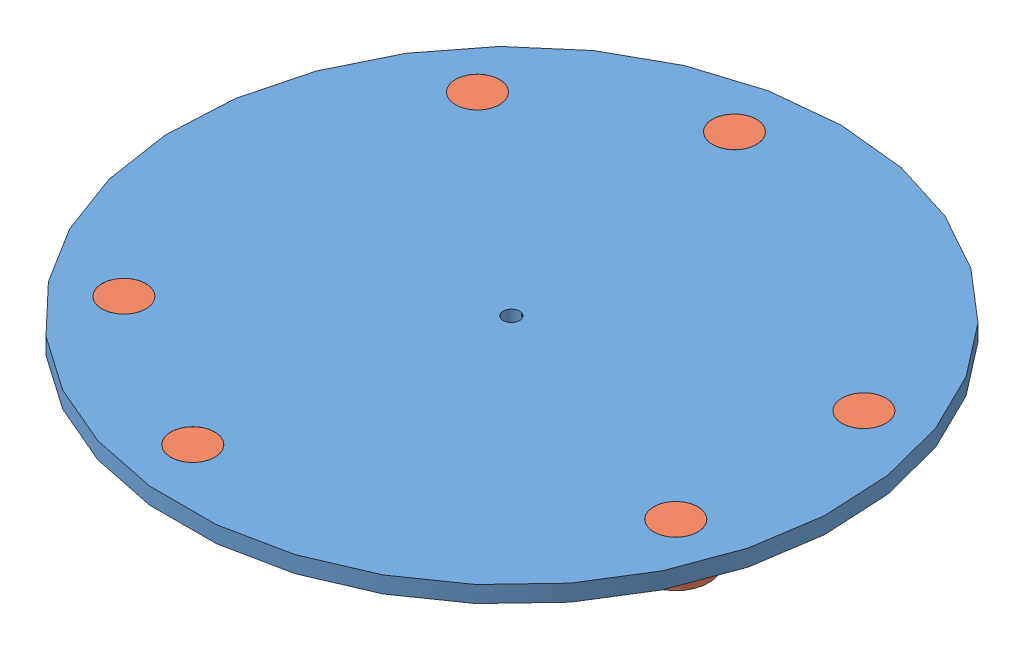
SolidWorks assembly Movingplate.SLDASM, configuration ﾃﾞﾌｫﾙﾄ (file format 4400). Lengths in mm.
Overall size (1200 70 1200).
7 component instances, 2 part files, 12 mates.
Components (placement in the parent):
- Movingplate-1: Movingplate.SLDPRT [ﾃﾞﾌｫﾙﾄ] at (-922.826 54.8355 0) size (1200 30 1200)
- Pivot-1: Pivot.SLDPRT [ﾃﾞﾌｫﾙﾄ] at (-1009.6501 84.8355 -492.4039) x (-0.787002 0 -0.61695) z (-0.61695 0 0.787002) size (120 70 120)
- Pivot-2: Pivot.SLDPRT [ﾃﾞﾌｫﾙﾄ] at (-1305.8482 84.8355 321.3938) x (-0.897605 0 -0.440802) z (-0.440802 0 0.897605) size (120 70 120)
- Pivot-3: Pivot.SLDPRT [ﾃﾞﾌｫﾙﾄ] at (-1305.8482 84.8355 -321.3938) x (-0.837169 0 -0.546944) z (-0.546944 0 0.837169) size (120 70 120)
- Pivot-4: Pivot.SLDPRT [ﾃﾞﾌｫﾙﾄ] at (-452.9797 84.8355 -171.0101) x (-0.976971 0 -0.213371) z (-0.213371 0 0.976971) size (120 70 120)
- Pivot-5: Pivot.SLDPRT [ﾃﾞﾌｫﾙﾄ] at (-452.9797 84.8355 171.0101) x (-0.976823 0 -0.214048) z (-0.214048 0 0.976823) size (120 70 120)
- Pivot-6: Pivot.SLDPRT [ﾃﾞﾌｫﾙﾄ] at (-1009.6501 84.8355 492.4039) x (-0.42221 0 -0.906498) z (-0.906498 0 0.42221) size (120 70 120)
Mates (geometry in assembly coordinates):
- 同心円1: concentric: cylinder of Pivot-2 through (-1305.8482 2.4299 321.3938) axis (0 1 0) radius 40; cylinder of Movingplate-1 through (-1305.8482 54.8355 321.3938) axis (0 1 0) radius 40
- 同心円3: concentric: cylinder of Pivot-1 through (-1009.6501 -28.2353 -492.4039) axis (0 1 0) radius 40; cylinder of Movingplate-1 through (-1009.6501 54.8355 -492.4039) axis (0 1 0) radius 40
- 同心円4: concentric: cylinder of Pivot-4 through (-452.9797 -37.7378 -171.0101) axis (0 1 0) radius 40; cylinder of Movingplate-1 through (-452.9797 54.8355 -171.0101) axis (0 1 0) radius 40
- 同心円5: concentric: cylinder of Pivot-5 through (-452.9797 8.8371 171.0101) axis (0 1 0) radius 40; cylinder of Movingplate-1 through (-452.9797 54.8355 171.0101) axis (0 1 0) radius 40
- 同心円6: concentric: cylinder of Pivot-6 through (-1009.6501 13.3068 492.4039) axis (0 1 0) radius 40; cylinder of Movingplate-1 through (-1009.6501 54.8355 492.4039) axis (0 1 0) radius 40
- 同心円8: concentric: cylinder of Pivot-3 through (-1305.8482 -134.9518 -321.3938) axis (0 1 0) radius 40; cylinder of Movingplate-1 through (-1305.8482 54.8355 -321.3938) axis (0 1 0) radius 40
- 一致2: coincident anti-aligned: plane of Movingplate-1 through (-922.826 54.8355 0) normal (0 -1 0); plane of Pivot-3 through (-1339.335 54.8355 -343.2716) normal (0 1 0)
- 一致3: coincident anti-aligned: plane of Movingplate-1 through (-922.826 54.8355 0) normal (0 -1 0); plane of Pivot-2 through (-1341.7524 54.8355 303.7617) normal (0 1 0)
- 一致4: coincident anti-aligned: plane of Movingplate-1 through (-922.826 54.8355 0) normal (0 -1 0); plane of Pivot-6 through (-1026.5385 54.8355 456.144) normal (0 1 0)
- 一致5: coincident anti-aligned: plane of Movingplate-1 through (-922.826 54.8355 0) normal (0 -1 0); plane of Pivot-1 through (-1041.1301 54.8355 -517.0819) normal (0 1 0)
- 一致6: coincident anti-aligned: plane of Movingplate-1 through (-922.826 54.8355 0) normal (0 -1 0); plane of Pivot-4 through (-492.0585 54.8355 -179.5449) normal (0 1 0)
- 一致7: coincident anti-aligned: plane of Movingplate-1 through (-922.826 54.8355 0) normal (0 -1 0); plane of Pivot-5 through (-492.0526 54.8355 162.4482) normal (0 1 0)
